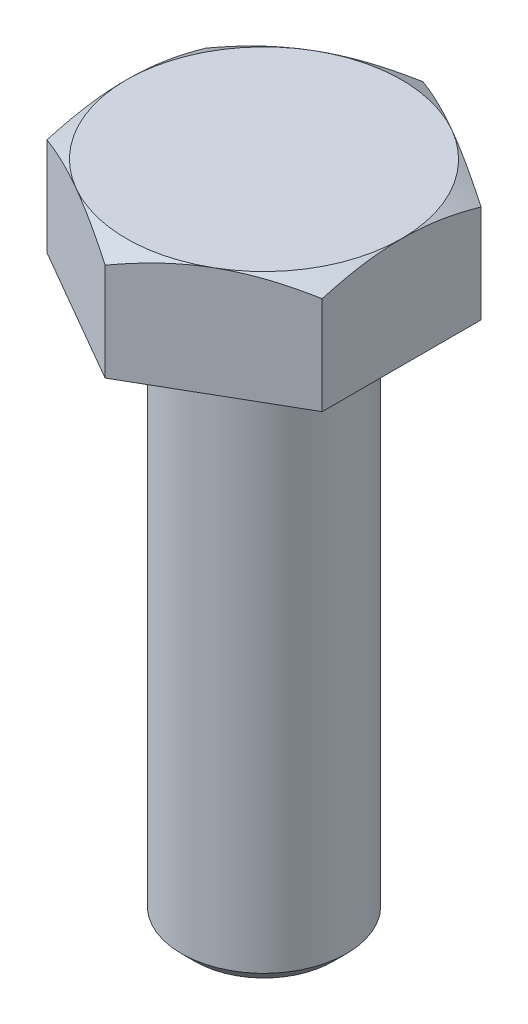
ISO-10303-21;
HEADER;
FILE_DESCRIPTION(('STEP AP214'),'2;1');
FILE_NAME('part.step','',(''),(''),'','','');
FILE_SCHEMA(('AUTOMOTIVE_DESIGN { 1 0 10303 214 1 1 1 1 }'));
ENDSEC;
DATA;
#1=APPLICATION_CONTEXT('core data for automotive mechanical design processes');
#2=APPLICATION_PROTOCOL_DEFINITION('international standard','automotive_design',2000,#1);
#3=PRODUCT_CONTEXT('',#1,'mechanical');
#4=PRODUCT('Part','Part','',(#3));
#5=PRODUCT_RELATED_PRODUCT_CATEGORY('part','',(#4));
#6=PRODUCT_DEFINITION_FORMATION('','',#4);
#7=PRODUCT_DEFINITION_CONTEXT('part definition',#1,'design');
#8=PRODUCT_DEFINITION('design','',#6,#7);
#9=PRODUCT_DEFINITION_SHAPE('','',#8);
#10=(LENGTH_UNIT() NAMED_UNIT(*) SI_UNIT(.MILLI.,.METRE.));
#11=(NAMED_UNIT(*) PLANE_ANGLE_UNIT() SI_UNIT($,.RADIAN.));
#12=(NAMED_UNIT(*) SI_UNIT($,.STERADIAN.) SOLID_ANGLE_UNIT());
#13=UNCERTAINTY_MEASURE_WITH_UNIT(LENGTH_MEASURE(1.E-05),#10,'distance_accuracy_value','');
#14=(GEOMETRIC_REPRESENTATION_CONTEXT(3) GLOBAL_UNCERTAINTY_ASSIGNED_CONTEXT((#13)) GLOBAL_UNIT_ASSIGNED_CONTEXT((#10,
#11,#12)) REPRESENTATION_CONTEXT('',''));
#15=CARTESIAN_POINT('',(0.,0.,0.));
#16=DIRECTION('',(0.,0.,1.));
#17=DIRECTION('',(1.,0.,0.));
#18=AXIS2_PLACEMENT_3D('',#15,#16,#17);
#19=CARTESIAN_POINT('',(4.99999999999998,4.,-2.88675134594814));
#20=DIRECTION('',(-0.5,0.,0.866025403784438));
#21=DIRECTION('',(0.866025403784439,0.,0.5));
#22=AXIS2_PLACEMENT_3D('',#19,#20,#21);
#23=PLANE('',#22);
#24=DIRECTION('',(0.,-1.,0.));
#25=VECTOR('',#24,1.);
#26=CARTESIAN_POINT('',(0.,4.,-5.77350269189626));
#27=LINE('',#26,#25);
#28=CARTESIAN_POINT('',(0.,3.5534180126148,-5.77350269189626));
#29=VERTEX_POINT('',#28);
#30=CARTESIAN_POINT('',(0.,0.,-5.77350269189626));
#31=VERTEX_POINT('',#30);
#32=EDGE_CURVE('E120',#29,#31,#27,.T.);
#33=ORIENTED_EDGE('',*,*,#32,.F.);
#34=CARTESIAN_POINT('',(-0.000200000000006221,3.55335134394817,-5.7736181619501));
#35=CARTESIAN_POINT('',(0.219534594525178,3.62661343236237,-5.64675433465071));
#36=CARTESIAN_POINT('',(0.441148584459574,3.69324867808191,-5.5188054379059));
#37=CARTESIAN_POINT('',(0.888213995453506,3.80956100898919,-5.26069210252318));
#38=CARTESIAN_POINT('',(1.11367335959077,3.85919695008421,-5.13052307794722));
#39=CARTESIAN_POINT('',(1.5618323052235,3.9364489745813,-4.87177839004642));
#40=CARTESIAN_POINT('',(1.78446209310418,3.96457962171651,-4.74324302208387));
#41=CARTESIAN_POINT('',(2.11918990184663,3.98980507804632,-4.54998783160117));
#42=CARTESIAN_POINT('',(2.23084219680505,3.99538654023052,-4.48552534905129));
#43=CARTESIAN_POINT('',(2.45424997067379,4.00079778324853,-4.35654081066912));
#44=CARTESIAN_POINT('',(2.5660054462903,4.0006277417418,-4.29201875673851));
#45=CARTESIAN_POINT('',(2.87218423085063,3.99224636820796,-4.11524635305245));
#46=CARTESIAN_POINT('',(3.0665060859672,3.97817022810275,-4.00305457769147));
#47=CARTESIAN_POINT('',(3.45386010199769,3.93353474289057,-3.77941563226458));
#48=CARTESIAN_POINT('',(3.64689090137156,3.9029601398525,-3.66796924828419));
#49=CARTESIAN_POINT('',(4.03502534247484,3.82653150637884,-3.44387972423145));
#50=CARTESIAN_POINT('',(4.23007999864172,3.78035362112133,-3.33126486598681));
#51=CARTESIAN_POINT('',(4.61728034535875,3.67554820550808,-3.10771464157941));
#52=CARTESIAN_POINT('',(4.80943099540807,3.61694529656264,-2.99677641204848));
#53=CARTESIAN_POINT('',(5.00019999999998,3.55335134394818,-2.8866358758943));
#54=B_SPLINE_CURVE_WITH_KNOTS('',3,(#34,#35,#36,#37,#38,#39,#40,#41,#42,#43,#44,#45,#46,#47,#48,
#49,#50,#51,#52,#53),.UNSPECIFIED.,.F.,.F.,(4,2,2,2,2,2,2,2,2,4),(0.,0.792555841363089,
1.58701660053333,2.3618153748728,2.74884076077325,3.13585419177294,3.80962362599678,
4.48401723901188,5.17336882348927,5.86136694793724),.UNSPECIFIED.);
#55=CARTESIAN_POINT('',(2.5,4.,-4.33012701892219));
#56=VERTEX_POINT('',#55);
#57=EDGE_CURVE('E104',#29,#56,#54,.T.);
#58=ORIENTED_EDGE('',*,*,#57,.T.);
#59=CARTESIAN_POINT('',(4.99999999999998,3.5534180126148,-2.88675134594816));
#60=VERTEX_POINT('',#59);
#61=EDGE_CURVE('E113',#56,#60,#54,.T.);
#62=ORIENTED_EDGE('',*,*,#61,.T.);
#63=DIRECTION('',(0.,-1.,0.));
#64=VECTOR('',#63,1.);
#65=CARTESIAN_POINT('',(4.99999999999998,4.,-2.88675134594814));
#66=LINE('',#65,#64);
#67=CARTESIAN_POINT('',(4.99999999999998,0.,-2.88675134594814));
#68=VERTEX_POINT('',#67);
#69=EDGE_CURVE('E358',#60,#68,#66,.T.);
#70=ORIENTED_EDGE('',*,*,#69,.T.);
#71=DIRECTION('',(-0.866025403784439,0.,-0.5));
#72=VECTOR('',#71,1.);
#73=CARTESIAN_POINT('',(4.99999999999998,0.,-2.88675134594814));
#74=LINE('',#73,#72);
#75=EDGE_CURVE('E127',#68,#31,#74,.T.);
#76=ORIENTED_EDGE('',*,*,#75,.T.);
#77=EDGE_LOOP('',(#33,#58,#62,#70,#76));
#78=FACE_BOUND('',#77,.T.);
#79=ADVANCED_FACE('F34',(#78),#23,.F.);
#80=CARTESIAN_POINT('',(0.,4.,-5.77350269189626));
#81=DIRECTION('',(0.5,0.,0.866025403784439));
#82=DIRECTION('',(0.866025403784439,0.,-0.5));
#83=AXIS2_PLACEMENT_3D('',#80,#81,#82);
#84=PLANE('',#83);
#85=DIRECTION('',(0.,-1.,0.));
#86=VECTOR('',#85,1.);
#87=CARTESIAN_POINT('',(-5.,4.,-2.88675134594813));
#88=LINE('',#87,#86);
#89=CARTESIAN_POINT('',(-5.,3.5534180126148,-2.88675134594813));
#90=VERTEX_POINT('',#89);
#91=CARTESIAN_POINT('',(-5.,0.,-2.88675134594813));
#92=VERTEX_POINT('',#91);
#93=EDGE_CURVE('E129',#90,#92,#88,.T.);
#94=ORIENTED_EDGE('',*,*,#93,.F.);
#95=CARTESIAN_POINT('',(-5.0002,3.55335134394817,-2.8866358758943));
#96=CARTESIAN_POINT('',(-4.78046540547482,3.62661343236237,-3.01349970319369));
#97=CARTESIAN_POINT('',(-4.55885141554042,3.69324867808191,-3.1414485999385));
#98=CARTESIAN_POINT('',(-4.11178600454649,3.80956100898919,-3.39956193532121));
#99=CARTESIAN_POINT('',(-3.88632664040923,3.85919695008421,-3.52973095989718));
#100=CARTESIAN_POINT('',(-3.43816769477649,3.9364489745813,-3.78847564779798));
#101=CARTESIAN_POINT('',(-3.21553790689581,3.96457962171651,-3.91701101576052));
#102=CARTESIAN_POINT('',(-2.88081009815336,3.98980507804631,-4.11026620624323));
#103=CARTESIAN_POINT('',(-2.76915780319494,3.99538654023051,-4.17472868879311));
#104=CARTESIAN_POINT('',(-2.54575002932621,4.00079778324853,-4.30371322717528));
#105=CARTESIAN_POINT('',(-2.43399455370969,4.00062774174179,-4.36823528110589));
#106=CARTESIAN_POINT('',(-2.12781576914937,3.99224636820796,-4.54500768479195));
#107=CARTESIAN_POINT('',(-1.93349391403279,3.97817022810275,-4.65719946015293));
#108=CARTESIAN_POINT('',(-1.5461398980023,3.93353474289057,-4.88083840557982));
#109=CARTESIAN_POINT('',(-1.35310909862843,3.90296013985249,-4.99228478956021));
#110=CARTESIAN_POINT('',(-0.964974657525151,3.82653150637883,-5.21637431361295));
#111=CARTESIAN_POINT('',(-0.76992000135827,3.78035362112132,-5.32898917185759));
#112=CARTESIAN_POINT('',(-0.382719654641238,3.67554820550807,-5.55253939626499));
#113=CARTESIAN_POINT('',(-0.19056900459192,3.61694529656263,-5.66347762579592));
#114=CARTESIAN_POINT('',(0.000199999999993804,3.55335134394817,-5.7736181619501));
#115=B_SPLINE_CURVE_WITH_KNOTS('',3,(#95,#96,#97,#98,#99,#100,#101,#102,#103,#104,#105,#106,
#107,#108,#109,#110,#111,#112,#113,#114),.UNSPECIFIED.,.F.,.F.,(4,2,2,2,2,2,2,2,2,4),(0.,
0.792555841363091,1.58701660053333,2.3618153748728,2.74884076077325,3.13585419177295,
3.80962362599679,4.48401723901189,5.17336882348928,5.86136694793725),.UNSPECIFIED.);
#116=CARTESIAN_POINT('',(-2.5,4.,-4.33012701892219));
#117=VERTEX_POINT('',#116);
#118=EDGE_CURVE('E122',#90,#117,#115,.T.);
#119=ORIENTED_EDGE('',*,*,#118,.T.);
#120=EDGE_CURVE('E57',#117,#29,#115,.T.);
#121=ORIENTED_EDGE('',*,*,#120,.T.);
#122=ORIENTED_EDGE('',*,*,#32,.T.);
#123=DIRECTION('',(-0.866025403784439,0.,0.5));
#124=VECTOR('',#123,1.);
#125=CARTESIAN_POINT('',(0.,0.,-5.77350269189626));
#126=LINE('',#125,#124);
#127=EDGE_CURVE('E367',#31,#92,#126,.T.);
#128=ORIENTED_EDGE('',*,*,#127,.T.);
#129=EDGE_LOOP('',(#94,#119,#121,#122,#128));
#130=FACE_BOUND('',#129,.T.);
#131=ADVANCED_FACE('F118',(#130),#84,.F.);
#132=CARTESIAN_POINT('',(-5.,4.,-2.88675134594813));
#133=DIRECTION('',(1.,0.,0.));
#134=DIRECTION('',(0.,0.,-1.));
#135=AXIS2_PLACEMENT_3D('',#132,#133,#134);
#136=PLANE('',#135);
#137=DIRECTION('',(0.,-1.,0.));
#138=VECTOR('',#137,1.);
#139=CARTESIAN_POINT('',(-5.,4.,2.88675134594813));
#140=LINE('',#139,#138);
#141=CARTESIAN_POINT('',(-4.99999999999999,3.55341801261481,2.88675134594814));
#142=VERTEX_POINT('',#141);
#143=CARTESIAN_POINT('',(-5.,0.,2.88675134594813));
#144=VERTEX_POINT('',#143);
#145=EDGE_CURVE('E135',#142,#144,#140,.T.);
#146=ORIENTED_EDGE('',*,*,#145,.F.);
#147=CARTESIAN_POINT('',(-5.,1.60736647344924,-7.65608998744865));
#148=CARTESIAN_POINT('',(-5.,1.71345466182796,-7.43656171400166));
#149=CARTESIAN_POINT('',(-5.,1.81848824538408,-7.21651440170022));
#150=CARTESIAN_POINT('',(-5.,2.02584356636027,-6.77510105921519));
#151=CARTESIAN_POINT('',(-5.,2.12816483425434,-6.55373480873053));
#152=CARTESIAN_POINT('',(-5.,2.33003192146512,-6.10820714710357));
#153=CARTESIAN_POINT('',(-5.,2.42955850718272,-5.88403698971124));
#154=CARTESIAN_POINT('',(-5.,2.62433676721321,-5.43385418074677));
#155=CARTESIAN_POINT('',(-5.,2.71958866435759,-5.20784162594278));
#156=CARTESIAN_POINT('',(-5.,2.90581169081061,-4.75080884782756));
#157=CARTESIAN_POINT('',(-5.,2.99671590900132,-4.51976121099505));
#158=CARTESIAN_POINT('',(-5.,3.17140469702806,-4.05494053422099));
#159=CARTESIAN_POINT('',(-5.,3.25518847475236,-3.82116719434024));
#160=CARTESIAN_POINT('',(-5.,3.41338536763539,-3.35100416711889));
#161=CARTESIAN_POINT('',(-5.,3.48781840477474,-3.11462125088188));
#162=CARTESIAN_POINT('',(-5.,3.62489560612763,-2.63849247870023));
#163=CARTESIAN_POINT('',(-5.,3.68754349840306,-2.3987477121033));
#164=CARTESIAN_POINT('',(-5.,3.79801224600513,-1.91574303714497));
#165=CARTESIAN_POINT('',(-5.,3.84582915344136,-1.672482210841));
#166=CARTESIAN_POINT('',(-5.,3.9234044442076,-1.18299359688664));
#167=CARTESIAN_POINT('',(-5.,3.95316281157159,-0.936765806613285));
#168=CARTESIAN_POINT('',(-5.,3.9823487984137,-0.567032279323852));
#169=CARTESIAN_POINT('',(-5.,3.98950368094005,-0.444105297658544));
#170=CARTESIAN_POINT('',(-5.,3.99860454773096,-0.19805300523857));
#171=CARTESIAN_POINT('',(-5.,4.00055059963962,-0.0749276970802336));
#172=CARTESIAN_POINT('',(-5.,3.99918152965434,0.171257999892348));
#173=CARTESIAN_POINT('',(-5.,3.99586788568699,0.294318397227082));
#174=CARTESIAN_POINT('',(-5.,3.98406340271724,0.540192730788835));
#175=CARTESIAN_POINT('',(-5.,3.97557230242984,0.663006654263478));
#176=CARTESIAN_POINT('',(-5.,3.9488936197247,0.960681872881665));
#177=CARTESIAN_POINT('',(-5.,3.92811103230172,1.1353143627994));
#178=CARTESIAN_POINT('',(-5.,3.87723434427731,1.4832167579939));
#179=CARTESIAN_POINT('',(-5.,3.84713900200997,1.65648647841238));
#180=CARTESIAN_POINT('',(-5.,3.77870120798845,2.00155426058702));
#181=CARTESIAN_POINT('',(-5.,3.7403505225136,2.17335067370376));
#182=CARTESIAN_POINT('',(-5.,3.65657169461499,2.51518168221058));
#183=CARTESIAN_POINT('',(-5.,3.611143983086,2.68521638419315));
#184=CARTESIAN_POINT('',(-5.,3.51311221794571,3.02770318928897));
#185=CARTESIAN_POINT('',(-5.,3.46035963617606,3.20011248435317));
#186=CARTESIAN_POINT('',(-5.,3.34964221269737,3.54310870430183));
#187=CARTESIAN_POINT('',(-5.,3.29168096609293,3.71369679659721));
#188=CARTESIAN_POINT('',(-5.,3.17174345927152,4.05236610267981));
#189=CARTESIAN_POINT('',(-5.,3.10979163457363,4.22045602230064));
#190=CARTESIAN_POINT('',(-5.,2.98225176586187,4.55533171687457));
#191=CARTESIAN_POINT('',(-5.,2.91666225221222,4.72211693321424));
#192=CARTESIAN_POINT('',(-5.,2.84961374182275,4.88829623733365));
#193=B_SPLINE_CURVE_WITH_KNOTS('',3,(#147,#148,#149,#150,#151,#152,#153,#154,#155,#156,#157,
#158,#159,#160,#161,#162,#163,#164,#165,#166,#167,#168,#169,#170,#171,#172,#173,#174,#175,#176,
#177,#178,#179,#180,#181,#182,#183,#184,#185,#186,#187,#188,#189,#190,#191,#192),.UNSPECIFIED.,
.F.,.F.,(4,2,2,2,2,2,2,2,2,2,2,2,2,2,2,2,2,2,2,2,2,2,4),(0.,0.73146474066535,1.46305528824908,
2.19883243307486,2.93457117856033,3.67934251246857,4.42419659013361,5.16743580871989,
5.91043951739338,6.65364083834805,7.39684281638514,7.76615414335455,8.13546067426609,
8.50466345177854,8.87388486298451,9.40118542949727,9.92855633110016,10.4564556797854,
10.9843228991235,11.5251202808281,12.0655472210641,12.6029322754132,13.1405360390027),.UNSPECIFIED.);
#194=CARTESIAN_POINT('',(-4.99999999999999,4.00000000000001,0.));
#195=VERTEX_POINT('',#194);
#196=EDGE_CURVE('E368',#142,#195,#193,.F.);
#197=ORIENTED_EDGE('',*,*,#196,.T.);
#198=EDGE_CURVE('E49',#195,#90,#193,.F.);
#199=ORIENTED_EDGE('',*,*,#198,.T.);
#200=ORIENTED_EDGE('',*,*,#93,.T.);
#201=DIRECTION('',(0.,0.,1.));
#202=VECTOR('',#201,1.);
#203=CARTESIAN_POINT('',(-5.,0.,-2.88675134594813));
#204=LINE('',#203,#202);
#205=EDGE_CURVE('E369',#92,#144,#204,.T.);
#206=ORIENTED_EDGE('',*,*,#205,.T.);
#207=EDGE_LOOP('',(#146,#197,#199,#200,#206));
#208=FACE_BOUND('',#207,.T.);
#209=ADVANCED_FACE('F216',(#208),#136,.F.);
#210=CARTESIAN_POINT('',(-5.,4.,2.88675134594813));
#211=DIRECTION('',(0.5,0.,-0.866025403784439));
#212=DIRECTION('',(-0.866025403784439,0.,-0.5));
#213=AXIS2_PLACEMENT_3D('',#210,#211,#212);
#214=PLANE('',#213);
#215=DIRECTION('',(0.,-1.,0.));
#216=VECTOR('',#215,1.);
#217=CARTESIAN_POINT('',(0.,4.,5.77350269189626));
#218=LINE('',#217,#216);
#219=CARTESIAN_POINT('',(0.,3.55341801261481,5.77350269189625));
#220=VERTEX_POINT('',#219);
#221=CARTESIAN_POINT('',(0.,0.,5.77350269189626));
#222=VERTEX_POINT('',#221);
#223=EDGE_CURVE('E380',#220,#222,#218,.T.);
#224=ORIENTED_EDGE('',*,*,#223,.F.);
#225=CARTESIAN_POINT('',(0.00019999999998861,3.55335134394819,5.77361816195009));
#226=CARTESIAN_POINT('',(-0.219534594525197,3.62661343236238,5.6467543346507));
#227=CARTESIAN_POINT('',(-0.441148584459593,3.69324867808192,5.51880543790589));
#228=CARTESIAN_POINT('',(-0.888213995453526,3.8095610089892,5.26069210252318));
#229=CARTESIAN_POINT('',(-1.11367335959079,3.85919695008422,5.13052307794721));
#230=CARTESIAN_POINT('',(-1.56183230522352,3.93644897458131,4.87177839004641));
#231=CARTESIAN_POINT('',(-1.7844620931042,3.96457962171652,4.74324302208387));
#232=CARTESIAN_POINT('',(-2.11918990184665,3.98980507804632,4.54998783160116));
#233=CARTESIAN_POINT('',(-2.23084219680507,3.99538654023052,4.48552534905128));
#234=CARTESIAN_POINT('',(-2.45424997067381,4.00079778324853,4.35654081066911));
#235=CARTESIAN_POINT('',(-2.56600544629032,4.0006277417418,4.2920187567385));
#236=CARTESIAN_POINT('',(-2.87218423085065,3.99224636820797,4.11524635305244));
#237=CARTESIAN_POINT('',(-3.06650608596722,3.97817022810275,4.00305457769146));
#238=CARTESIAN_POINT('',(-3.45386010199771,3.93353474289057,3.77941563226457));
#239=CARTESIAN_POINT('',(-3.64689090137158,3.9029601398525,3.66796924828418));
#240=CARTESIAN_POINT('',(-4.03502534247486,3.82653150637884,3.44387972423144));
#241=CARTESIAN_POINT('',(-4.23007999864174,3.78035362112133,3.3312648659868));
#242=CARTESIAN_POINT('',(-4.61728034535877,3.67554820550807,3.10771464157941));
#243=CARTESIAN_POINT('',(-4.80943099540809,3.61694529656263,2.99677641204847));
#244=CARTESIAN_POINT('',(-5.0002,3.55335134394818,2.88663587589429));
#245=B_SPLINE_CURVE_WITH_KNOTS('',3,(#225,#226,#227,#228,#229,#230,#231,#232,#233,#234,#235,
#236,#237,#238,#239,#240,#241,#242,#243,#244),.UNSPECIFIED.,.F.,.F.,(4,2,2,2,2,2,2,2,2,4),(0.,
0.79255584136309,1.58701660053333,2.3618153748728,2.74884076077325,3.13585419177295,
3.80962362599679,4.48401723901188,5.17336882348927,5.86136694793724),.UNSPECIFIED.);
#246=CARTESIAN_POINT('',(-2.49999999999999,4.00000000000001,4.33012701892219));
#247=VERTEX_POINT('',#246);
#248=EDGE_CURVE('E123',#220,#247,#245,.T.);
#249=ORIENTED_EDGE('',*,*,#248,.T.);
#250=EDGE_CURVE('E384',#247,#142,#245,.T.);
#251=ORIENTED_EDGE('',*,*,#250,.T.);
#252=ORIENTED_EDGE('',*,*,#145,.T.);
#253=DIRECTION('',(0.866025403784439,0.,0.5));
#254=VECTOR('',#253,1.);
#255=CARTESIAN_POINT('',(-5.,0.,2.88675134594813));
#256=LINE('',#255,#254);
#257=EDGE_CURVE('E375',#144,#222,#256,.T.);
#258=ORIENTED_EDGE('',*,*,#257,.T.);
#259=EDGE_LOOP('',(#224,#249,#251,#252,#258));
#260=FACE_BOUND('',#259,.T.);
#261=ADVANCED_FACE('F232',(#260),#214,.F.);
#262=CARTESIAN_POINT('',(0.,4.,5.77350269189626));
#263=DIRECTION('',(-0.5,0.,-0.866025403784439));
#264=DIRECTION('',(-0.866025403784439,0.,0.5));
#265=AXIS2_PLACEMENT_3D('',#262,#263,#264);
#266=PLANE('',#265);
#267=DIRECTION('',(0.,-1.,0.));
#268=VECTOR('',#267,1.);
#269=CARTESIAN_POINT('',(4.99999999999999,4.,2.88675134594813));
#270=LINE('',#269,#268);
#271=CARTESIAN_POINT('',(4.99999999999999,3.55341801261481,2.88675134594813));
#272=VERTEX_POINT('',#271);
#273=CARTESIAN_POINT('',(4.99999999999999,0.,2.88675134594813));
#274=VERTEX_POINT('',#273);
#275=EDGE_CURVE('E168',#272,#274,#270,.T.);
#276=ORIENTED_EDGE('',*,*,#275,.F.);
#277=CARTESIAN_POINT('',(5.00019999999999,3.55335134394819,2.88663587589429));
#278=CARTESIAN_POINT('',(4.78046540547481,3.62661343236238,3.01349970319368));
#279=CARTESIAN_POINT('',(4.55885141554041,3.69324867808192,3.14144859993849));
#280=CARTESIAN_POINT('',(4.11178600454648,3.8095610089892,3.39956193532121));
#281=CARTESIAN_POINT('',(3.88632664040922,3.85919695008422,3.52973095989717));
#282=CARTESIAN_POINT('',(3.43816769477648,3.93644897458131,3.78847564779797));
#283=CARTESIAN_POINT('',(3.2155379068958,3.96457962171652,3.91701101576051));
#284=CARTESIAN_POINT('',(2.88081009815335,3.98980507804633,4.11026620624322));
#285=CARTESIAN_POINT('',(2.76915780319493,3.99538654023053,4.1747286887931));
#286=CARTESIAN_POINT('',(2.5457500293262,4.00079778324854,4.30371322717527));
#287=CARTESIAN_POINT('',(2.43399455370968,4.00062774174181,4.36823528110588));
#288=CARTESIAN_POINT('',(2.12781576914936,3.99224636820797,4.54500768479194));
#289=CARTESIAN_POINT('',(1.93349391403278,3.97817022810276,4.65719946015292));
#290=CARTESIAN_POINT('',(1.54613989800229,3.93353474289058,4.88083840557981));
#291=CARTESIAN_POINT('',(1.35310909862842,3.9029601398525,4.9922847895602));
#292=CARTESIAN_POINT('',(0.964974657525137,3.82653150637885,5.21637431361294));
#293=CARTESIAN_POINT('',(0.769920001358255,3.78035362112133,5.32898917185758));
#294=CARTESIAN_POINT('',(0.382719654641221,3.67554820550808,5.55253939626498));
#295=CARTESIAN_POINT('',(0.190569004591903,3.61694529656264,5.66347762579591));
#296=CARTESIAN_POINT('',(-0.00020000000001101,3.55335134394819,5.77361816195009));
#297=B_SPLINE_CURVE_WITH_KNOTS('',3,(#277,#278,#279,#280,#281,#282,#283,#284,#285,#286,#287,
#288,#289,#290,#291,#292,#293,#294,#295,#296),.UNSPECIFIED.,.F.,.F.,(4,2,2,2,2,2,2,2,2,4),(0.,
0.792555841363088,1.58701660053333,2.3618153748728,2.74884076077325,3.13585419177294,
3.80962362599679,4.48401723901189,5.17336882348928,5.86136694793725),.UNSPECIFIED.);
#298=CARTESIAN_POINT('',(2.49999999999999,4.00000000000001,4.33012701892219));
#299=VERTEX_POINT('',#298);
#300=EDGE_CURVE('E150',#272,#299,#297,.T.);
#301=ORIENTED_EDGE('',*,*,#300,.T.);
#302=EDGE_CURVE('E112',#299,#220,#297,.T.);
#303=ORIENTED_EDGE('',*,*,#302,.T.);
#304=ORIENTED_EDGE('',*,*,#223,.T.);
#305=DIRECTION('',(0.866025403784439,0.,-0.5));
#306=VECTOR('',#305,1.);
#307=CARTESIAN_POINT('',(0.,0.,5.77350269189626));
#308=LINE('',#307,#306);
#309=EDGE_CURVE('E364',#222,#274,#308,.T.);
#310=ORIENTED_EDGE('',*,*,#309,.T.);
#311=EDGE_LOOP('',(#276,#301,#303,#304,#310));
#312=FACE_BOUND('',#311,.T.);
#313=ADVANCED_FACE('F166',(#312),#266,.F.);
#314=CARTESIAN_POINT('',(4.99999999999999,4.,2.88675134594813));
#315=DIRECTION('',(-1.,0.,0.));
#316=DIRECTION('',(0.,0.,1.));
#317=AXIS2_PLACEMENT_3D('',#314,#315,#316);
#318=PLANE('',#317);
#319=ORIENTED_EDGE('',*,*,#69,.F.);
#320=CARTESIAN_POINT('',(4.99999999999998,1.60736647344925,-7.65608998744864));
#321=CARTESIAN_POINT('',(4.99999999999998,1.71345466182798,-7.43656171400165));
#322=CARTESIAN_POINT('',(4.99999999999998,1.81848824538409,-7.21651440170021));
#323=CARTESIAN_POINT('',(4.99999999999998,2.02584356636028,-6.77510105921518));
#324=CARTESIAN_POINT('',(4.99999999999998,2.12816483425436,-6.55373480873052));
#325=CARTESIAN_POINT('',(4.99999999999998,2.33003192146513,-6.10820714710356));
#326=CARTESIAN_POINT('',(4.99999999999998,2.42955850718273,-5.88403698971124));
#327=CARTESIAN_POINT('',(4.99999999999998,2.62433676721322,-5.43385418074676));
#328=CARTESIAN_POINT('',(4.99999999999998,2.7195886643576,-5.20784162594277));
#329=CARTESIAN_POINT('',(4.99999999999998,2.90581169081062,-4.75080884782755));
#330=CARTESIAN_POINT('',(4.99999999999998,2.99671590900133,-4.51976121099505));
#331=CARTESIAN_POINT('',(4.99999999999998,3.17140469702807,-4.05494053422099));
#332=CARTESIAN_POINT('',(4.99999999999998,3.25518847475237,-3.82116719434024));
#333=CARTESIAN_POINT('',(4.99999999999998,3.4133853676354,-3.35100416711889));
#334=CARTESIAN_POINT('',(4.99999999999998,3.48781840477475,-3.11462125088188));
#335=CARTESIAN_POINT('',(4.99999999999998,3.62489560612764,-2.63849247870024));
#336=CARTESIAN_POINT('',(4.99999999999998,3.68754349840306,-2.39874771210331));
#337=CARTESIAN_POINT('',(4.99999999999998,3.79801224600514,-1.91574303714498));
#338=CARTESIAN_POINT('',(4.99999999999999,3.84582915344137,-1.67248221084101));
#339=CARTESIAN_POINT('',(4.99999999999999,3.92340444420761,-1.18299359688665));
#340=CARTESIAN_POINT('',(4.99999999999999,3.9531628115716,-0.936765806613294));
#341=CARTESIAN_POINT('',(4.99999999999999,3.98234879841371,-0.567032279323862));
#342=CARTESIAN_POINT('',(4.99999999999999,3.98950368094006,-0.444105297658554));
#343=CARTESIAN_POINT('',(4.99999999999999,3.99860454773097,-0.198053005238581));
#344=CARTESIAN_POINT('',(4.99999999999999,4.00055059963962,-0.0749276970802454));
#345=CARTESIAN_POINT('',(4.99999999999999,3.99918152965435,0.171257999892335));
#346=CARTESIAN_POINT('',(4.99999999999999,3.995867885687,0.294318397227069));
#347=CARTESIAN_POINT('',(4.99999999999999,3.98406340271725,0.54019273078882));
#348=CARTESIAN_POINT('',(4.99999999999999,3.97557230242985,0.663006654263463));
#349=CARTESIAN_POINT('',(4.99999999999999,3.94889361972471,0.960681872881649));
#350=CARTESIAN_POINT('',(4.99999999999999,3.92811103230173,1.13531436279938));
#351=CARTESIAN_POINT('',(4.99999999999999,3.87723434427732,1.48321675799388));
#352=CARTESIAN_POINT('',(4.99999999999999,3.84713900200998,1.65648647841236));
#353=CARTESIAN_POINT('',(4.99999999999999,3.77870120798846,2.001554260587));
#354=CARTESIAN_POINT('',(4.99999999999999,3.74035052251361,2.17335067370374));
#355=CARTESIAN_POINT('',(4.99999999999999,3.656571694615,2.51518168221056));
#356=CARTESIAN_POINT('',(4.99999999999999,3.61114398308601,2.68521638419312));
#357=CARTESIAN_POINT('',(4.99999999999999,3.51311221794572,3.02770318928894));
#358=CARTESIAN_POINT('',(4.99999999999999,3.46035963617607,3.20011248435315));
#359=CARTESIAN_POINT('',(4.99999999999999,3.34964221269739,3.5431087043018));
#360=CARTESIAN_POINT('',(4.99999999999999,3.29168096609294,3.71369679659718));
#361=CARTESIAN_POINT('',(4.99999999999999,3.17174345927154,4.05236610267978));
#362=CARTESIAN_POINT('',(4.99999999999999,3.10979163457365,4.22045602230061));
#363=CARTESIAN_POINT('',(4.99999999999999,2.98225176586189,4.55533171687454));
#364=CARTESIAN_POINT('',(4.99999999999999,2.91666225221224,4.7221169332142));
#365=CARTESIAN_POINT('',(4.99999999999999,2.84961374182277,4.88829623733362));
#366=B_SPLINE_CURVE_WITH_KNOTS('',3,(#320,#321,#322,#323,#324,#325,#326,#327,#328,#329,#330,
#331,#332,#333,#334,#335,#336,#337,#338,#339,#340,#341,#342,#343,#344,#345,#346,#347,#348,#349,
#350,#351,#352,#353,#354,#355,#356,#357,#358,#359,#360,#361,#362,#363,#364,#365),.UNSPECIFIED.,
.F.,.F.,(4,2,2,2,2,2,2,2,2,2,2,2,2,2,2,2,2,2,2,2,2,2,4),(0.,0.731464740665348,1.46305528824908,
2.19883243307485,2.93457117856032,3.67934251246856,4.42419659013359,5.16743580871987,
5.91043951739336,6.65364083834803,7.39684281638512,7.76615414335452,8.13546067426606,
8.50466345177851,8.87388486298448,9.40118542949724,9.92855633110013,10.4564556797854,
10.9843228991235,11.525120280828,12.065547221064,12.6029322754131,13.1405360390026),.UNSPECIFIED.);
#367=CARTESIAN_POINT('',(4.99999999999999,4.00000000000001,0.));
#368=VERTEX_POINT('',#367);
#369=EDGE_CURVE('E169',#60,#368,#366,.T.);
#370=ORIENTED_EDGE('',*,*,#369,.T.);
#371=EDGE_CURVE('E152',#368,#272,#366,.T.);
#372=ORIENTED_EDGE('',*,*,#371,.T.);
#373=ORIENTED_EDGE('',*,*,#275,.T.);
#374=DIRECTION('',(0.,0.,-1.));
#375=VECTOR('',#374,1.);
#376=CARTESIAN_POINT('',(4.99999999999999,0.,2.88675134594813));
#377=LINE('',#376,#375);
#378=EDGE_CURVE('E359',#274,#68,#377,.T.);
#379=ORIENTED_EDGE('',*,*,#378,.T.);
#380=EDGE_LOOP('',(#319,#370,#372,#373,#379));
#381=FACE_BOUND('',#380,.T.);
#382=ADVANCED_FACE('F245',(#381),#318,.F.);
#383=CARTESIAN_POINT('',(0.,0.,0.));
#384=DIRECTION('',(0.,1.,0.));
#385=DIRECTION('',(0.,0.,1.));
#386=AXIS2_PLACEMENT_3D('',#383,#384,#385);
#387=PLANE('',#386);
#388=CARTESIAN_POINT('',(0.,0.,0.));
#389=DIRECTION('',(0.,1.,0.));
#390=DIRECTION('',(0.,0.,1.));
#391=AXIS2_PLACEMENT_3D('',#388,#389,#390);
#392=CIRCLE('',#391,3.);
#393=CARTESIAN_POINT('',(0.,0.,3.00000000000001));
#394=VERTEX_POINT('',#393);
#395=EDGE_CURVE('E353',#394,#394,#392,.T.);
#396=ORIENTED_EDGE('',*,*,#395,.T.);
#397=EDGE_LOOP('',(#396));
#398=FACE_BOUND('',#397,.T.);
#399=ORIENTED_EDGE('',*,*,#75,.F.);
#400=ORIENTED_EDGE('',*,*,#378,.F.);
#401=ORIENTED_EDGE('',*,*,#309,.F.);
#402=ORIENTED_EDGE('',*,*,#257,.F.);
#403=ORIENTED_EDGE('',*,*,#205,.F.);
#404=ORIENTED_EDGE('',*,*,#127,.F.);
#405=EDGE_LOOP('',(#399,#400,#401,#402,#403,#404));
#406=FACE_BOUND('',#405,.T.);
#407=ADVANCED_FACE('F251',(#398,#406),#387,.F.);
#408=CARTESIAN_POINT('',(0.,4.00000000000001,0.));
#409=DIRECTION('',(0.,-1.,0.));
#410=DIRECTION('',(0.,0.,-1.));
#411=AXIS2_PLACEMENT_3D('',#408,#409,#410);
#412=CONICAL_SURFACE('',#411,4.99999999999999,1.0471975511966);
#413=ORIENTED_EDGE('',*,*,#302,.F.);
#414=CARTESIAN_POINT('',(0.,4.,0.));
#415=DIRECTION('',(0.,1.,0.));
#416=DIRECTION('',(0.,0.,1.));
#417=AXIS2_PLACEMENT_3D('',#414,#415,#416);
#418=CIRCLE('',#417,5.00000000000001);
#419=EDGE_CURVE('E128',#299,#247,#418,.F.);
#420=ORIENTED_EDGE('',*,*,#419,.T.);
#421=ORIENTED_EDGE('',*,*,#248,.F.);
#422=EDGE_LOOP('',(#413,#420,#421));
#423=FACE_BOUND('',#422,.T.);
#424=ADVANCED_FACE('F159',(#423),#412,.T.);
#425=ORIENTED_EDGE('',*,*,#371,.F.);
#426=EDGE_CURVE('E132',#368,#299,#418,.F.);
#427=ORIENTED_EDGE('',*,*,#426,.T.);
#428=ORIENTED_EDGE('',*,*,#300,.F.);
#429=EDGE_LOOP('',(#425,#427,#428));
#430=FACE_BOUND('',#429,.T.);
#431=ADVANCED_FACE('F148',(#430),#412,.T.);
#432=CARTESIAN_POINT('',(0.,4.00000000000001,0.));
#433=DIRECTION('',(0.,-1.,0.));
#434=DIRECTION('',(0.,0.,-1.));
#435=AXIS2_PLACEMENT_3D('',#432,#433,#434);
#436=CIRCLE('',#435,4.99999999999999);
#437=EDGE_CURVE('E354',#56,#368,#436,.T.);
#438=ORIENTED_EDGE('',*,*,#437,.T.);
#439=ORIENTED_EDGE('',*,*,#369,.F.);
#440=ORIENTED_EDGE('',*,*,#61,.F.);
#441=EDGE_LOOP('',(#438,#439,#440));
#442=FACE_BOUND('',#441,.T.);
#443=ADVANCED_FACE('F266',(#442),#412,.T.);
#444=EDGE_CURVE('E107',#117,#56,#418,.F.);
#445=ORIENTED_EDGE('',*,*,#444,.T.);
#446=ORIENTED_EDGE('',*,*,#57,.F.);
#447=ORIENTED_EDGE('',*,*,#120,.F.);
#448=EDGE_LOOP('',(#445,#446,#447));
#449=FACE_BOUND('',#448,.T.);
#450=ADVANCED_FACE('F105',(#449),#412,.T.);
#451=EDGE_CURVE('E141',#195,#117,#418,.F.);
#452=ORIENTED_EDGE('',*,*,#451,.T.);
#453=ORIENTED_EDGE('',*,*,#118,.F.);
#454=ORIENTED_EDGE('',*,*,#198,.F.);
#455=EDGE_LOOP('',(#452,#453,#454));
#456=FACE_BOUND('',#455,.T.);
#457=ADVANCED_FACE('F192',(#456),#412,.T.);
#458=ORIENTED_EDGE('',*,*,#250,.F.);
#459=EDGE_CURVE('E134',#247,#195,#418,.F.);
#460=ORIENTED_EDGE('',*,*,#459,.T.);
#461=ORIENTED_EDGE('',*,*,#196,.F.);
#462=EDGE_LOOP('',(#458,#460,#461));
#463=FACE_BOUND('',#462,.T.);
#464=ADVANCED_FACE('F187',(#463),#412,.T.);
#465=CARTESIAN_POINT('',(0.,4.,0.));
#466=DIRECTION('',(0.,1.,0.));
#467=DIRECTION('',(0.,0.,1.));
#468=AXIS2_PLACEMENT_3D('',#465,#466,#467);
#469=PLANE('',#468);
#470=ORIENTED_EDGE('',*,*,#459,.F.);
#471=ORIENTED_EDGE('',*,*,#419,.F.);
#472=ORIENTED_EDGE('',*,*,#426,.F.);
#473=ORIENTED_EDGE('',*,*,#437,.F.);
#474=ORIENTED_EDGE('',*,*,#444,.F.);
#475=ORIENTED_EDGE('',*,*,#451,.F.);
#476=EDGE_LOOP('',(#470,#471,#472,#473,#474,#475));
#477=FACE_BOUND('',#476,.T.);
#478=ADVANCED_FACE('F164',(#477),#469,.T.);
#479=CARTESIAN_POINT('',(0.,-20.,0.));
#480=DIRECTION('',(0.,1.,0.));
#481=DIRECTION('',(0.,0.,1.));
#482=AXIS2_PLACEMENT_3D('',#479,#480,#481);
#483=CYLINDRICAL_SURFACE('',#482,3.);
#484=CARTESIAN_POINT('',(0.,-19.5,0.));
#485=DIRECTION('',(0.,1.,0.));
#486=DIRECTION('',(0.,0.,1.));
#487=AXIS2_PLACEMENT_3D('',#484,#485,#486);
#488=CIRCLE('',#487,3.);
#489=CARTESIAN_POINT('',(0.,-19.5,3.00000000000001));
#490=VERTEX_POINT('',#489);
#491=EDGE_CURVE('E42',#490,#490,#488,.T.);
#492=ORIENTED_EDGE('',*,*,#491,.T.);
#493=EDGE_LOOP('',(#492));
#494=FACE_BOUND('',#493,.T.);
#495=ORIENTED_EDGE('',*,*,#395,.F.);
#496=EDGE_LOOP('',(#495));
#497=FACE_BOUND('',#496,.T.);
#498=ADVANCED_FACE('F193',(#494,#497),#483,.T.);
#499=CARTESIAN_POINT('',(0.,-20.,0.));
#500=DIRECTION('',(0.,1.,0.));
#501=DIRECTION('',(0.,0.,1.));
#502=AXIS2_PLACEMENT_3D('',#499,#500,#501);
#503=PLANE('',#502);
#504=CARTESIAN_POINT('',(0.,-20.,0.));
#505=DIRECTION('',(0.,1.,0.));
#506=DIRECTION('',(0.,0.,1.));
#507=AXIS2_PLACEMENT_3D('',#504,#505,#506);
#508=CIRCLE('',#507,2.5);
#509=CARTESIAN_POINT('',(0.,-20.,2.50000000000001));
#510=VERTEX_POINT('',#509);
#511=EDGE_CURVE('E11',#510,#510,#508,.F.);
#512=ORIENTED_EDGE('',*,*,#511,.T.);
#513=EDGE_LOOP('',(#512));
#514=FACE_BOUND('',#513,.T.);
#515=ADVANCED_FACE('F300',(#514),#503,.F.);
#516=CARTESIAN_POINT('',(0.,-19.5,0.));
#517=DIRECTION('',(0.,1.,0.));
#518=DIRECTION('',(0.,0.,1.));
#519=AXIS2_PLACEMENT_3D('',#516,#517,#518);
#520=CONICAL_SURFACE('',#519,3.,0.785398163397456);
#521=ORIENTED_EDGE('',*,*,#511,.F.);
#522=EDGE_LOOP('',(#521));
#523=FACE_BOUND('',#522,.T.);
#524=ORIENTED_EDGE('',*,*,#491,.F.);
#525=EDGE_LOOP('',(#524));
#526=FACE_BOUND('',#525,.T.);
#527=ADVANCED_FACE('F36',(#523,#526),#520,.T.);
#528=CLOSED_SHELL('',(#79,#131,#209,#261,#313,#382,#407,#424,#431,#443,#450,#457,#464,#478,#498,
#515,#527));
#529=MANIFOLD_SOLID_BREP('B2',#528);
#530=ADVANCED_BREP_SHAPE_REPRESENTATION('',(#18,#529),#14);
#531=SHAPE_DEFINITION_REPRESENTATION(#9,#530);
ENDSEC;
END-ISO-10303-21;
